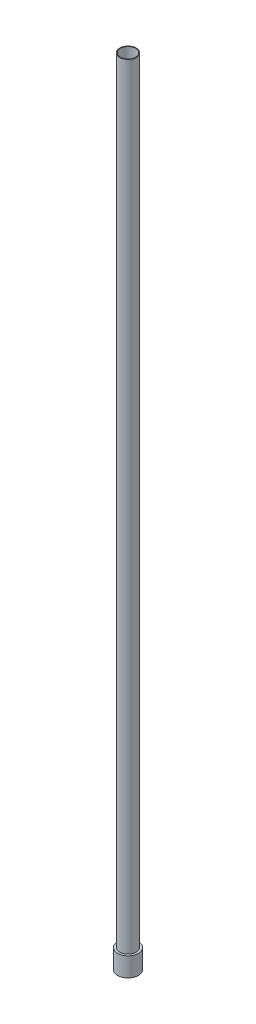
from build123d import *


with BuildPart() as part:
    # Sketch2 → Revolve1 (revolve)
    with BuildSketch(Plane.XY, mode=Mode.PRIVATE) as revolve1_sk:
        Polygon((-2.921, 0), (-3.9624, 0), (-3.9624, 7.366), (-3.175, 7.366), (-3.175, 304.8), (-2.921, 304.8), align=None)
    revolve(revolve1_sk.sketch.rotate(Axis((0, 0, 0), (0, 1, 0)), 270), axis=Axis((0, 0, 0), (0, 1, 0)))


solid = part.part
